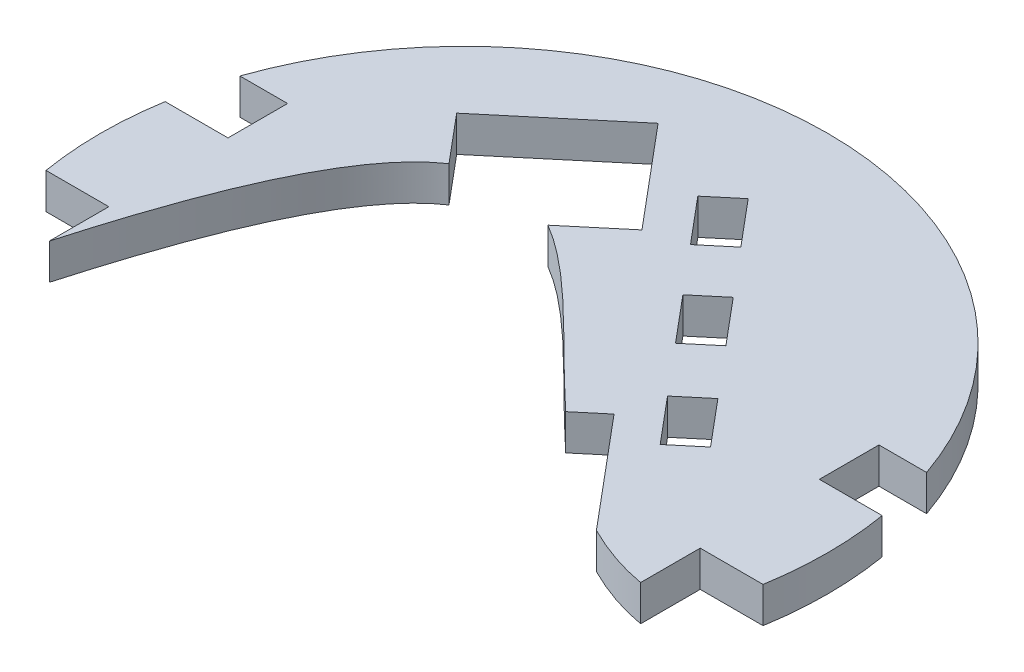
from build123d import *

# Parameters (mm, degrees)
CROQUIS1_R              = 30.5
SALIENTE_EXTRUIR1_DEPTH = 3
CROQUIS2_R              = 2
CORTAR_EXTRUIR1_DEPTH   = 4
CORTAR_EXTRUIR3_START   = -4
CORTAR_EXTRUIR3_DEPTH   = 4
CORTAR_EXTRUIR5_START   = -4
CORTAR_EXTRUIR5_DEPTH   = 4
CORTAR_EXTRUIR6_DEPTH   = 10


with BuildPart() as part:
    # Croquis1 → Saliente-Extruir1 (new body)
    with BuildSketch(Plane(origin=(0, 0, 0), x_dir=(1, 0, 0), z_dir=(0, 1, 0))):
        with Locations(Location((0, 0, 0), (0, 0, 270))):
            Circle(CROQUIS1_R)
    extrude(amount=SALIENTE_EXTRUIR1_DEPTH)

    # Croquis2 → Cortar-Extruir1 (cut)
    with BuildSketch(Plane(origin=(0, 3, 0), x_dir=(1, 0, 0), z_dir=(0, 1, 0))):
        with Locations(Location((0, 0, 0), (0, 0, 270))):
            Circle(CROQUIS2_R)
    extrude(amount=-CORTAR_EXTRUIR1_DEPTH, mode=Mode.SUBTRACT)

    # Croquis5 → Cortar-Extruir3 (cut)
    with BuildSketch(Plane(origin=(0, 3, 0), x_dir=(1, 0, 0), z_dir=(0, 1, 0)).offset(CORTAR_EXTRUIR3_START)):
        with BuildLine():
            Line((28.814059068, 5), (30.087372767, 5))
            ThreePointArc((30.087372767, 5), (29.556634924, 7.526973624), (28.814059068, 10))
            Line((28.814059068, 10), (24.814059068, 10))
            Line((24.814059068, 10), (24.814059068, 5))
            Line((24.814059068, 5), (28.814059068, 5))
        make_face()
        with BuildLine():
            Line((30.087372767, -5), (28.814059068, -5))
            Line((28.814059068, -5), (24.814059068, -5))
            Line((24.814059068, -5), (24.814059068, -10))
            Line((24.814059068, -10), (28.814059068, -10))
            ThreePointArc((28.814059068, -10), (29.556634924, -7.526973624), (30.087372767, -5))
        make_face()
        with BuildLine():
            Line((-24.814059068, 5), (-24.814059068, 10))
            Line((-24.814059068, 10), (-28.814059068, 10))
            ThreePointArc((-28.814059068, 10), (-29.556634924, 7.526973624), (-30.087372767, 5))
            Line((-30.087372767, 5), (-28.814059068, 5))
            Line((-28.814059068, 5), (-24.814059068, 5))
        make_face()
        with BuildLine():
            Line((-28.814059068, -10), (-24.814059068, -10))
            Line((-24.814059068, -10), (-24.814059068, -5))
            Line((-24.814059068, -5), (-28.814059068, -5))
            Line((-28.814059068, -5), (-30.087372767, -5))
            ThreePointArc((-30.087372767, -5), (-29.556634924, -7.526973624), (-28.814059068, -10))
        make_face()
    extrude(amount=CORTAR_EXTRUIR3_DEPTH, mode=Mode.SUBTRACT)

    # Croquis7 → Cortar-Extruir5 (cut)
    with BuildSketch(Plane(origin=(0, 3, 0), x_dir=(1, 0, 0), z_dir=(0, 1, 0)).offset(CORTAR_EXTRUIR5_START)):
        Polygon((1.428390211, 22.411430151), (-0.869743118, 20.483067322), (2.34419493, 16.652845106), (4.642328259, 18.581207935), align=None)
        with BuildLine():
            Line((-24.814059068, -10), (-28.814059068, -10))
            ThreePointArc((-28.814059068, -10), (0, -30.5), (28.814059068, -10))
            Line((28.814059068, -10), (24.814059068, -10))
            add(Edge.make_bspline(
                [(24.814059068, -10), (22.863263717, -9.657344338), (20.984021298, -8.980450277), (19.168992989, -8.065339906)],
                knots=[0, 0, 0, 0, 0.087850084, 0.087850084, 0.087850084, 0.087850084], degree=3))
            Line((19.168992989, -8.065339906), (11.455541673, 1.127193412))
            Line((11.455541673, 1.127193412), (9.248678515, -0.72458465))
            add(Edge.make_bspline(
                [(9.248678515, -0.72458465), (4.033234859, 4.116641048), (-0.646914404, 9.508508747), (-5.04935939, 12.080675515)],
                knots=[0.258799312, 0.258799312, 0.258799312, 0.258799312, 0.546435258, 0.546435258, 0.546435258, 0.546435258], degree=3))
            Line((-5.04935939, 12.080675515), (-0.757422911, 15.682037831))
            Line((-0.757422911, 15.682037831), (-7.828086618, 24.108526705))
            Line((-7.828086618, 24.108526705), (-17.020619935, 16.395075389))
            Line((-17.020619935, 16.395075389), (-13.66601447, 12.397212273))
            add(Edge.make_bspline(
                [(-13.66601447, 12.397212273), (-17.403465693, 9.897923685), (-21.056529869, 3.255841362), (-24.814059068, -10)],
                knots=[0.740637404, 0.740637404, 0.740637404, 0.740637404, 1, 1, 1, 1], degree=3))
        make_face()
        Polygon((14.685884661, 6.611763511), (12.387751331, 4.683400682), (15.60168938, 0.853178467), (17.899822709, 2.781541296), align=None)
    extrude(amount=CORTAR_EXTRUIR5_DEPTH, mode=Mode.SUBTRACT)

    # Croquis9 → Cortar-Extruir6 (cut)
    with BuildSketch(Plane(origin=(0, 3, 0), x_dir=(1, 0, 0), z_dir=(0, 1, 0))):
        Polygon((7.971418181, 14.613753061), (5.673284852, 12.685390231), (8.887222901, 8.855168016), (11.18535623, 10.783530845), align=None)
    extrude(amount=-CORTAR_EXTRUIR6_DEPTH, mode=Mode.SUBTRACT)


solid = part.part
